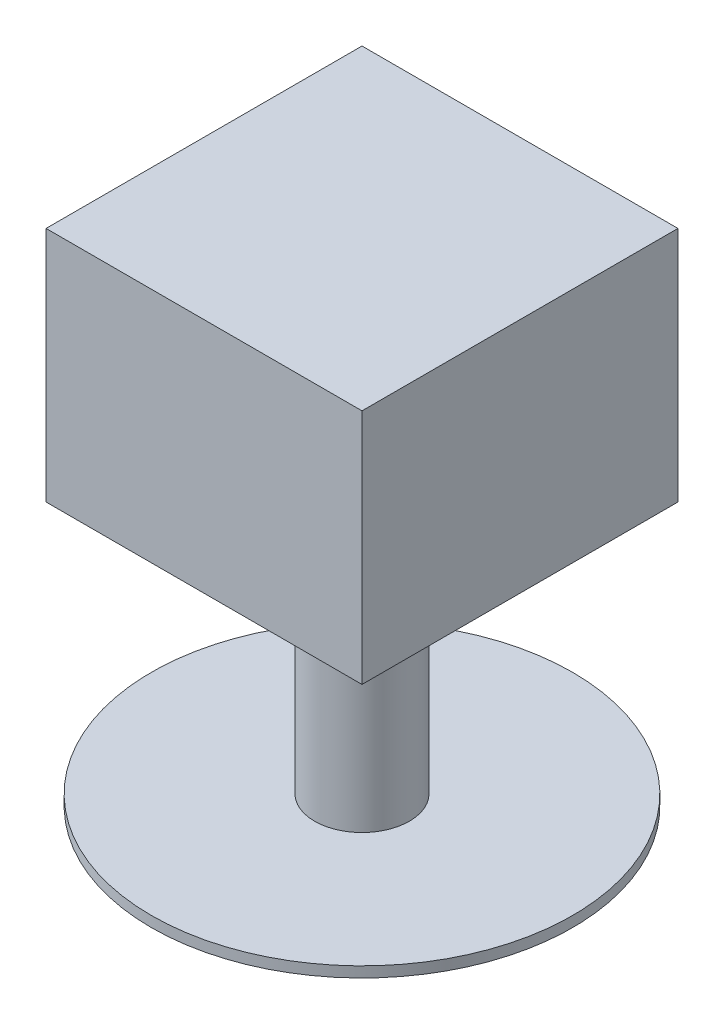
ISO-10303-21;
HEADER;
FILE_DESCRIPTION(('STEP AP214'),'2;1');
FILE_NAME('part.step','',(''),(''),'','','');
FILE_SCHEMA(('AUTOMOTIVE_DESIGN { 1 0 10303 214 1 1 1 1 }'));
ENDSEC;
DATA;
#1=APPLICATION_CONTEXT('core data for automotive mechanical design processes');
#2=APPLICATION_PROTOCOL_DEFINITION('international standard','automotive_design',2000,#1);
#3=PRODUCT_CONTEXT('',#1,'mechanical');
#4=PRODUCT('Part','Part','',(#3));
#5=PRODUCT_RELATED_PRODUCT_CATEGORY('part','',(#4));
#6=PRODUCT_DEFINITION_FORMATION('','',#4);
#7=PRODUCT_DEFINITION_CONTEXT('part definition',#1,'design');
#8=PRODUCT_DEFINITION('design','',#6,#7);
#9=PRODUCT_DEFINITION_SHAPE('','',#8);
#10=(LENGTH_UNIT() NAMED_UNIT(*) SI_UNIT(.MILLI.,.METRE.));
#11=(NAMED_UNIT(*) PLANE_ANGLE_UNIT() SI_UNIT($,.RADIAN.));
#12=(NAMED_UNIT(*) SI_UNIT($,.STERADIAN.) SOLID_ANGLE_UNIT());
#13=UNCERTAINTY_MEASURE_WITH_UNIT(LENGTH_MEASURE(1.E-05),#10,'distance_accuracy_value','');
#14=(GEOMETRIC_REPRESENTATION_CONTEXT(3) GLOBAL_UNCERTAINTY_ASSIGNED_CONTEXT((#13)) GLOBAL_UNIT_ASSIGNED_CONTEXT((#10,
#11,#12)) REPRESENTATION_CONTEXT('',''));
#15=CARTESIAN_POINT('',(0.,0.,0.));
#16=DIRECTION('',(0.,0.,1.));
#17=DIRECTION('',(1.,0.,0.));
#18=AXIS2_PLACEMENT_3D('',#15,#16,#17);
#19=CARTESIAN_POINT('',(0.,-68.,0.));
#20=DIRECTION('',(0.,1.,0.));
#21=DIRECTION('',(0.,0.,1.));
#22=AXIS2_PLACEMENT_3D('',#19,#20,#21);
#23=PLANE('',#22);
#24=CARTESIAN_POINT('',(0.,-68.,0.));
#25=DIRECTION('',(0.,1.,0.));
#26=DIRECTION('',(0.,0.,1.));
#27=AXIS2_PLACEMENT_3D('',#24,#25,#26);
#28=CIRCLE('',#27,40.);
#29=CARTESIAN_POINT('',(0.,-68.,40.));
#30=VERTEX_POINT('',#29);
#31=EDGE_CURVE('E11',#30,#30,#28,.T.);
#32=ORIENTED_EDGE('',*,*,#31,.T.);
#33=EDGE_LOOP('',(#32));
#34=FACE_BOUND('',#33,.T.);
#35=CARTESIAN_POINT('',(0.,-68.,0.));
#36=DIRECTION('',(0.,1.,0.));
#37=DIRECTION('',(0.,0.,1.));
#38=AXIS2_PLACEMENT_3D('',#35,#36,#37);
#39=CIRCLE('',#38,9.);
#40=CARTESIAN_POINT('',(0.,-68.,9.));
#41=VERTEX_POINT('',#40);
#42=EDGE_CURVE('E110',#41,#41,#39,.T.);
#43=ORIENTED_EDGE('',*,*,#42,.F.);
#44=EDGE_LOOP('',(#43));
#45=FACE_BOUND('',#44,.T.);
#46=ADVANCED_FACE('F33',(#34,#45),#23,.T.);
#47=CARTESIAN_POINT('',(0.,-68.,0.));
#48=DIRECTION('',(0.,-1.,0.));
#49=DIRECTION('',(0.,0.,-1.));
#50=AXIS2_PLACEMENT_3D('',#47,#48,#49);
#51=CYLINDRICAL_SURFACE('',#50,40.);
#52=ORIENTED_EDGE('',*,*,#31,.F.);
#53=EDGE_LOOP('',(#52));
#54=FACE_BOUND('',#53,.T.);
#55=CARTESIAN_POINT('',(0.,-70.,0.));
#56=DIRECTION('',(0.,1.,0.));
#57=DIRECTION('',(0.,0.,1.));
#58=AXIS2_PLACEMENT_3D('',#55,#56,#57);
#59=CIRCLE('',#58,40.);
#60=CARTESIAN_POINT('',(0.,-70.,40.));
#61=VERTEX_POINT('',#60);
#62=EDGE_CURVE('E37',#61,#61,#59,.T.);
#63=ORIENTED_EDGE('',*,*,#62,.T.);
#64=EDGE_LOOP('',(#63));
#65=FACE_BOUND('',#64,.T.);
#66=ADVANCED_FACE('F35',(#54,#65),#51,.T.);
#67=CARTESIAN_POINT('',(0.,-70.,0.));
#68=DIRECTION('',(0.,1.,0.));
#69=DIRECTION('',(0.,0.,1.));
#70=AXIS2_PLACEMENT_3D('',#67,#68,#69);
#71=PLANE('',#70);
#72=ORIENTED_EDGE('',*,*,#62,.F.);
#73=EDGE_LOOP('',(#72));
#74=FACE_BOUND('',#73,.T.);
#75=ADVANCED_FACE('F121',(#74),#71,.F.);
#76=CARTESIAN_POINT('',(0.,5.4558441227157,0.));
#77=DIRECTION('',(0.,-1.,0.));
#78=DIRECTION('',(0.,0.,-1.));
#79=AXIS2_PLACEMENT_3D('',#76,#77,#78);
#80=CYLINDRICAL_SURFACE('',#79,9.);
#81=ORIENTED_EDGE('',*,*,#42,.T.);
#82=EDGE_LOOP('',(#81));
#83=FACE_BOUND('',#82,.T.);
#84=CARTESIAN_POINT('',(0.,-20.,0.));
#85=DIRECTION('',(0.,1.,0.));
#86=DIRECTION('',(0.,0.,1.));
#87=AXIS2_PLACEMENT_3D('',#84,#85,#86);
#88=CIRCLE('',#87,9.);
#89=CARTESIAN_POINT('',(0.,-20.,9.));
#90=VERTEX_POINT('',#89);
#91=EDGE_CURVE('E113',#90,#90,#88,.T.);
#92=ORIENTED_EDGE('',*,*,#91,.F.);
#93=EDGE_LOOP('',(#92));
#94=FACE_BOUND('',#93,.T.);
#95=ADVANCED_FACE('F123',(#83,#94),#80,.T.);
#96=CARTESIAN_POINT('',(30.,-20.,-30.));
#97=DIRECTION('',(0.,1.,0.));
#98=DIRECTION('',(0.,0.,1.));
#99=AXIS2_PLACEMENT_3D('',#96,#97,#98);
#100=PLANE('',#99);
#101=DIRECTION('',(0.,0.,-1.));
#102=VECTOR('',#101,1.);
#103=CARTESIAN_POINT('',(30.,-20.,30.));
#104=LINE('',#103,#102);
#105=CARTESIAN_POINT('',(30.,-20.,30.));
#106=VERTEX_POINT('',#105);
#107=CARTESIAN_POINT('',(30.,-20.,-30.));
#108=VERTEX_POINT('',#107);
#109=EDGE_CURVE('E101',#106,#108,#104,.T.);
#110=ORIENTED_EDGE('',*,*,#109,.F.);
#111=DIRECTION('',(1.,0.,0.));
#112=VECTOR('',#111,1.);
#113=CARTESIAN_POINT('',(30.,-20.,30.));
#114=LINE('',#113,#112);
#115=CARTESIAN_POINT('',(-30.,-20.,30.));
#116=VERTEX_POINT('',#115);
#117=EDGE_CURVE('E73',#116,#106,#114,.T.);
#118=ORIENTED_EDGE('',*,*,#117,.F.);
#119=DIRECTION('',(0.,0.,1.));
#120=VECTOR('',#119,1.);
#121=CARTESIAN_POINT('',(-30.,-20.,30.));
#122=LINE('',#121,#120);
#123=CARTESIAN_POINT('',(-30.,-20.,-30.));
#124=VERTEX_POINT('',#123);
#125=EDGE_CURVE('E67',#124,#116,#122,.T.);
#126=ORIENTED_EDGE('',*,*,#125,.F.);
#127=DIRECTION('',(-1.,0.,0.));
#128=VECTOR('',#127,1.);
#129=CARTESIAN_POINT('',(30.,-20.,-30.));
#130=LINE('',#129,#128);
#131=EDGE_CURVE('E91',#108,#124,#130,.T.);
#132=ORIENTED_EDGE('',*,*,#131,.F.);
#133=EDGE_LOOP('',(#110,#118,#126,#132));
#134=FACE_BOUND('',#133,.T.);
#135=ORIENTED_EDGE('',*,*,#91,.T.);
#136=EDGE_LOOP('',(#135));
#137=FACE_BOUND('',#136,.T.);
#138=ADVANCED_FACE('F128',(#134,#137),#100,.F.);
#139=CARTESIAN_POINT('',(30.,25.,30.));
#140=DIRECTION('',(-1.,0.,0.));
#141=DIRECTION('',(0.,0.,1.));
#142=AXIS2_PLACEMENT_3D('',#139,#140,#141);
#143=PLANE('',#142);
#144=ORIENTED_EDGE('',*,*,#109,.T.);
#145=DIRECTION('',(0.,-1.,0.));
#146=VECTOR('',#145,1.);
#147=CARTESIAN_POINT('',(30.,25.,-30.));
#148=LINE('',#147,#146);
#149=CARTESIAN_POINT('',(30.,25.,-30.));
#150=VERTEX_POINT('',#149);
#151=EDGE_CURVE('E92',#150,#108,#148,.T.);
#152=ORIENTED_EDGE('',*,*,#151,.F.);
#153=DIRECTION('',(0.,0.,-1.));
#154=VECTOR('',#153,1.);
#155=CARTESIAN_POINT('',(30.,25.,30.));
#156=LINE('',#155,#154);
#157=CARTESIAN_POINT('',(30.,25.,30.));
#158=VERTEX_POINT('',#157);
#159=EDGE_CURVE('E86',#158,#150,#156,.T.);
#160=ORIENTED_EDGE('',*,*,#159,.F.);
#161=DIRECTION('',(0.,-1.,0.));
#162=VECTOR('',#161,1.);
#163=CARTESIAN_POINT('',(30.,25.,30.));
#164=LINE('',#163,#162);
#165=EDGE_CURVE('E97',#158,#106,#164,.T.);
#166=ORIENTED_EDGE('',*,*,#165,.T.);
#167=EDGE_LOOP('',(#144,#152,#160,#166));
#168=FACE_BOUND('',#167,.T.);
#169=ADVANCED_FACE('F139',(#168),#143,.F.);
#170=CARTESIAN_POINT('',(30.,25.,-30.));
#171=DIRECTION('',(0.,0.,1.));
#172=DIRECTION('',(1.,0.,0.));
#173=AXIS2_PLACEMENT_3D('',#170,#171,#172);
#174=PLANE('',#173);
#175=ORIENTED_EDGE('',*,*,#131,.T.);
#176=DIRECTION('',(0.,-1.,0.));
#177=VECTOR('',#176,1.);
#178=CARTESIAN_POINT('',(-30.,25.,-30.));
#179=LINE('',#178,#177);
#180=CARTESIAN_POINT('',(-30.,25.,-30.));
#181=VERTEX_POINT('',#180);
#182=EDGE_CURVE('E89',#181,#124,#179,.T.);
#183=ORIENTED_EDGE('',*,*,#182,.F.);
#184=DIRECTION('',(-1.,0.,0.));
#185=VECTOR('',#184,1.);
#186=CARTESIAN_POINT('',(30.,25.,-30.));
#187=LINE('',#186,#185);
#188=EDGE_CURVE('E81',#150,#181,#187,.T.);
#189=ORIENTED_EDGE('',*,*,#188,.F.);
#190=ORIENTED_EDGE('',*,*,#151,.T.);
#191=EDGE_LOOP('',(#175,#183,#189,#190));
#192=FACE_BOUND('',#191,.T.);
#193=ADVANCED_FACE('F90',(#192),#174,.F.);
#194=CARTESIAN_POINT('',(-30.,25.,30.));
#195=DIRECTION('',(1.,0.,0.));
#196=DIRECTION('',(0.,0.,-1.));
#197=AXIS2_PLACEMENT_3D('',#194,#195,#196);
#198=PLANE('',#197);
#199=ORIENTED_EDGE('',*,*,#125,.T.);
#200=DIRECTION('',(0.,-1.,0.));
#201=VECTOR('',#200,1.);
#202=CARTESIAN_POINT('',(-30.,25.,30.));
#203=LINE('',#202,#201);
#204=CARTESIAN_POINT('',(-30.,25.,30.));
#205=VERTEX_POINT('',#204);
#206=EDGE_CURVE('E93',#205,#116,#203,.T.);
#207=ORIENTED_EDGE('',*,*,#206,.F.);
#208=DIRECTION('',(0.,0.,1.));
#209=VECTOR('',#208,1.);
#210=CARTESIAN_POINT('',(-30.,25.,30.));
#211=LINE('',#210,#209);
#212=EDGE_CURVE('E84',#181,#205,#211,.T.);
#213=ORIENTED_EDGE('',*,*,#212,.F.);
#214=ORIENTED_EDGE('',*,*,#182,.T.);
#215=EDGE_LOOP('',(#199,#207,#213,#214));
#216=FACE_BOUND('',#215,.T.);
#217=ADVANCED_FACE('F95',(#216),#198,.F.);
#218=CARTESIAN_POINT('',(30.,25.,30.));
#219=DIRECTION('',(0.,0.,-1.));
#220=DIRECTION('',(-1.,0.,0.));
#221=AXIS2_PLACEMENT_3D('',#218,#219,#220);
#222=PLANE('',#221);
#223=ORIENTED_EDGE('',*,*,#117,.T.);
#224=ORIENTED_EDGE('',*,*,#165,.F.);
#225=DIRECTION('',(1.,0.,0.));
#226=VECTOR('',#225,1.);
#227=CARTESIAN_POINT('',(30.,25.,30.));
#228=LINE('',#227,#226);
#229=EDGE_CURVE('E50',#205,#158,#228,.T.);
#230=ORIENTED_EDGE('',*,*,#229,.F.);
#231=ORIENTED_EDGE('',*,*,#206,.T.);
#232=EDGE_LOOP('',(#223,#224,#230,#231));
#233=FACE_BOUND('',#232,.T.);
#234=ADVANCED_FACE('F147',(#233),#222,.F.);
#235=CARTESIAN_POINT('',(30.,25.,-30.));
#236=DIRECTION('',(0.,1.,0.));
#237=DIRECTION('',(0.,0.,1.));
#238=AXIS2_PLACEMENT_3D('',#235,#236,#237);
#239=PLANE('',#238);
#240=ORIENTED_EDGE('',*,*,#159,.T.);
#241=ORIENTED_EDGE('',*,*,#188,.T.);
#242=ORIENTED_EDGE('',*,*,#212,.T.);
#243=ORIENTED_EDGE('',*,*,#229,.T.);
#244=EDGE_LOOP('',(#240,#241,#242,#243));
#245=FACE_BOUND('',#244,.T.);
#246=ADVANCED_FACE('F82',(#245),#239,.T.);
#247=CLOSED_SHELL('',(#46,#66,#75,#95,#138,#169,#193,#217,#234,#246));
#248=MANIFOLD_SOLID_BREP('B2',#247);
#249=ADVANCED_BREP_SHAPE_REPRESENTATION('',(#18,#248),#14);
#250=SHAPE_DEFINITION_REPRESENTATION(#9,#249);
ENDSEC;
END-ISO-10303-21;
